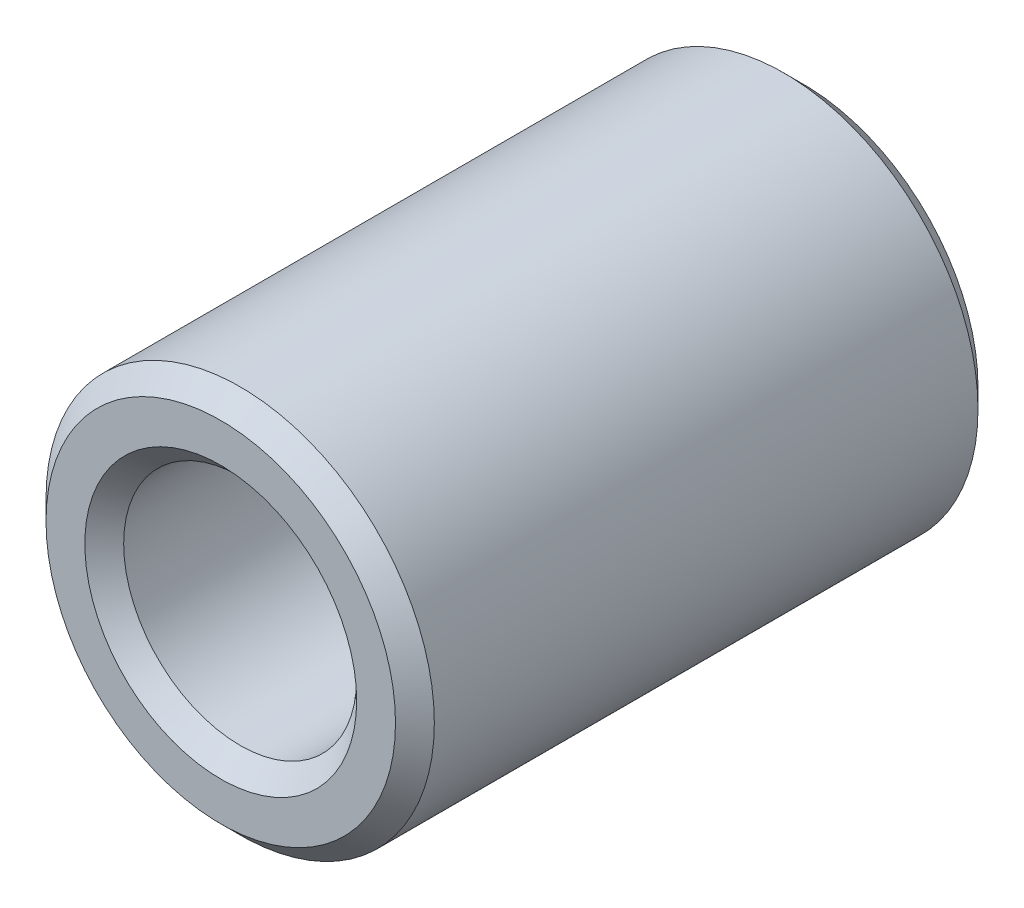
from build123d import *

# Parameters (mm, degrees)
ESQUISSE1_R   = 5
ESQUISSE1_R_2 = 3
CORPS_DEPTH   = 15
CHANF_SIZE    = 0.5


with BuildPart() as part:
    # Esquisse1 → Corps (new body)
    with BuildSketch(Plane.XY):
        Circle(ESQUISSE1_R)
        Circle(ESQUISSE1_R_2, mode=Mode.SUBTRACT)
    extrude(amount=-CORPS_DEPTH)

    # Chanf
    chanf_edges = [part.edges().sort_by_distance(p)[0] for p in [
        (-5, 0, 0),
        (-5, 0, -15),
        (-3, 0, 0),
        (-3, 0, -15),
    ]]
    chamfer(chanf_edges, length=CHANF_SIZE)


solid = part.part
